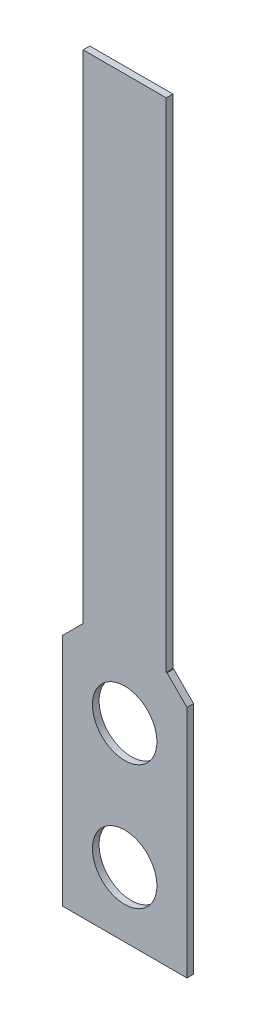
ISO-10303-21;
HEADER;
FILE_DESCRIPTION(('STEP AP214'),'2;1');
FILE_NAME('part.step','',(''),(''),'','','');
FILE_SCHEMA(('AUTOMOTIVE_DESIGN { 1 0 10303 214 1 1 1 1 }'));
ENDSEC;
DATA;
#1=APPLICATION_CONTEXT('core data for automotive mechanical design processes');
#2=APPLICATION_PROTOCOL_DEFINITION('international standard','automotive_design',2000,#1);
#3=PRODUCT_CONTEXT('',#1,'mechanical');
#4=PRODUCT('Part','Part','',(#3));
#5=PRODUCT_RELATED_PRODUCT_CATEGORY('part','',(#4));
#6=PRODUCT_DEFINITION_FORMATION('','',#4);
#7=PRODUCT_DEFINITION_CONTEXT('part definition',#1,'design');
#8=PRODUCT_DEFINITION('design','',#6,#7);
#9=PRODUCT_DEFINITION_SHAPE('','',#8);
#10=(LENGTH_UNIT() NAMED_UNIT(*) SI_UNIT(.MILLI.,.METRE.));
#11=(NAMED_UNIT(*) PLANE_ANGLE_UNIT() SI_UNIT($,.RADIAN.));
#12=(NAMED_UNIT(*) SI_UNIT($,.STERADIAN.) SOLID_ANGLE_UNIT());
#13=UNCERTAINTY_MEASURE_WITH_UNIT(LENGTH_MEASURE(1.E-05),#10,'distance_accuracy_value','');
#14=(GEOMETRIC_REPRESENTATION_CONTEXT(3) GLOBAL_UNCERTAINTY_ASSIGNED_CONTEXT((#13)) GLOBAL_UNIT_ASSIGNED_CONTEXT((#10,
#11,#12)) REPRESENTATION_CONTEXT('',''));
#15=CARTESIAN_POINT('',(0.,0.,0.));
#16=DIRECTION('',(0.,0.,1.));
#17=DIRECTION('',(1.,0.,0.));
#18=AXIS2_PLACEMENT_3D('',#15,#16,#17);
#19=CARTESIAN_POINT('',(3.17500000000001,9.7155,0.508));
#20=DIRECTION('',(0.,-1.,0.));
#21=DIRECTION('',(0.,0.,-1.));
#22=AXIS2_PLACEMENT_3D('',#19,#20,#21);
#23=PLANE('',#22);
#24=DIRECTION('',(-1.,0.,0.));
#25=VECTOR('',#24,1.);
#26=CARTESIAN_POINT('',(3.17500000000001,9.7155,0.508));
#27=LINE('',#26,#25);
#28=CARTESIAN_POINT('',(3.23849999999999,9.7155,0.508));
#29=VERTEX_POINT('',#28);
#30=CARTESIAN_POINT('',(3.17500000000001,9.7155,0.508));
#31=VERTEX_POINT('',#30);
#32=EDGE_CURVE('E144',#29,#31,#27,.T.);
#33=ORIENTED_EDGE('',*,*,#32,.F.);
#34=DIRECTION('',(0.,0.,-1.));
#35=VECTOR('',#34,1.);
#36=CARTESIAN_POINT('',(3.23849999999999,9.7155,0.508));
#37=LINE('',#36,#35);
#38=CARTESIAN_POINT('',(3.23849999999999,9.7155,0.));
#39=VERTEX_POINT('',#38);
#40=EDGE_CURVE('E42',#29,#39,#37,.T.);
#41=ORIENTED_EDGE('',*,*,#40,.T.);
#42=DIRECTION('',(-1.,0.,0.));
#43=VECTOR('',#42,1.);
#44=CARTESIAN_POINT('',(3.17500000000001,9.7155,0.));
#45=LINE('',#44,#43);
#46=CARTESIAN_POINT('',(3.17500000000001,9.7155,0.));
#47=VERTEX_POINT('',#46);
#48=EDGE_CURVE('E135',#39,#47,#45,.T.);
#49=ORIENTED_EDGE('',*,*,#48,.T.);
#50=DIRECTION('',(0.,0.,-1.));
#51=VECTOR('',#50,1.);
#52=CARTESIAN_POINT('',(3.17500000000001,9.7155,0.508));
#53=LINE('',#52,#51);
#54=EDGE_CURVE('E154',#31,#47,#53,.T.);
#55=ORIENTED_EDGE('',*,*,#54,.F.);
#56=EDGE_LOOP('',(#33,#41,#49,#55));
#57=FACE_BOUND('',#56,.T.);
#58=ADVANCED_FACE('F34',(#57),#23,.F.);
#59=CARTESIAN_POINT('',(3.17500000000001,60.2615,0.508));
#60=DIRECTION('',(-1.,0.,0.));
#61=DIRECTION('',(0.,-1.,0.));
#62=AXIS2_PLACEMENT_3D('',#59,#60,#61);
#63=PLANE('',#62);
#64=DIRECTION('',(0.,1.,0.));
#65=VECTOR('',#64,1.);
#66=CARTESIAN_POINT('',(3.17500000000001,60.2615,0.));
#67=LINE('',#66,#65);
#68=CARTESIAN_POINT('',(3.17500000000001,47.7434076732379,0.));
#69=VERTEX_POINT('',#68);
#70=EDGE_CURVE('E131',#47,#69,#67,.T.);
#71=ORIENTED_EDGE('',*,*,#70,.T.);
#72=DIRECTION('',(0.,0.,1.));
#73=VECTOR('',#72,1.);
#74=CARTESIAN_POINT('',(3.17500000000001,47.7434076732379,0.));
#75=LINE('',#74,#73);
#76=CARTESIAN_POINT('',(3.17500000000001,47.7434076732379,0.508));
#77=VERTEX_POINT('',#76);
#78=EDGE_CURVE('E49',#69,#77,#75,.T.);
#79=ORIENTED_EDGE('',*,*,#78,.T.);
#80=DIRECTION('',(0.,1.,0.));
#81=VECTOR('',#80,1.);
#82=CARTESIAN_POINT('',(3.17500000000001,60.2615,0.508));
#83=LINE('',#82,#81);
#84=EDGE_CURVE('E192',#31,#77,#83,.T.);
#85=ORIENTED_EDGE('',*,*,#84,.F.);
#86=ORIENTED_EDGE('',*,*,#54,.T.);
#87=EDGE_LOOP('',(#71,#79,#85,#86));
#88=FACE_BOUND('',#87,.T.);
#89=ADVANCED_FACE('F208',(#88),#63,.F.);
#90=CARTESIAN_POINT('',(-3.17499999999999,60.2615,0.508));
#91=DIRECTION('',(1.,0.,0.));
#92=DIRECTION('',(0.,1.,0.));
#93=AXIS2_PLACEMENT_3D('',#90,#91,#92);
#94=PLANE('',#93);
#95=DIRECTION('',(0.,-1.,0.));
#96=VECTOR('',#95,1.);
#97=CARTESIAN_POINT('',(-3.17499999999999,60.2615,0.508));
#98=LINE('',#97,#96);
#99=CARTESIAN_POINT('',(-3.17499999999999,47.7434076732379,0.508));
#100=VERTEX_POINT('',#99);
#101=CARTESIAN_POINT('',(-3.17499999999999,9.7155,0.508));
#102=VERTEX_POINT('',#101);
#103=EDGE_CURVE('E125',#100,#102,#98,.T.);
#104=ORIENTED_EDGE('',*,*,#103,.F.);
#105=DIRECTION('',(0.,0.,1.));
#106=VECTOR('',#105,1.);
#107=CARTESIAN_POINT('',(-3.17499999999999,47.7434076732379,0.));
#108=LINE('',#107,#106);
#109=CARTESIAN_POINT('',(-3.17499999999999,47.7434076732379,0.));
#110=VERTEX_POINT('',#109);
#111=EDGE_CURVE('E111',#110,#100,#108,.T.);
#112=ORIENTED_EDGE('',*,*,#111,.F.);
#113=DIRECTION('',(0.,-1.,0.));
#114=VECTOR('',#113,1.);
#115=CARTESIAN_POINT('',(-3.17499999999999,60.2615,0.));
#116=LINE('',#115,#114);
#117=CARTESIAN_POINT('',(-3.17499999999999,9.7155,0.));
#118=VERTEX_POINT('',#117);
#119=EDGE_CURVE('E123',#110,#118,#116,.T.);
#120=ORIENTED_EDGE('',*,*,#119,.T.);
#121=DIRECTION('',(0.,0.,-1.));
#122=VECTOR('',#121,1.);
#123=CARTESIAN_POINT('',(-3.17499999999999,9.7155,0.508));
#124=LINE('',#123,#122);
#125=EDGE_CURVE('E152',#102,#118,#124,.T.);
#126=ORIENTED_EDGE('',*,*,#125,.F.);
#127=EDGE_LOOP('',(#104,#112,#120,#126));
#128=FACE_BOUND('',#127,.T.);
#129=ADVANCED_FACE('F121',(#128),#94,.F.);
#130=CARTESIAN_POINT('',(-4.7625,9.7155,0.508));
#131=DIRECTION('',(0.,-1.,0.));
#132=DIRECTION('',(0.,0.,-1.));
#133=AXIS2_PLACEMENT_3D('',#130,#131,#132);
#134=PLANE('',#133);
#135=DIRECTION('',(-1.,0.,0.));
#136=VECTOR('',#135,1.);
#137=CARTESIAN_POINT('',(-4.7625,9.7155,0.));
#138=LINE('',#137,#136);
#139=CARTESIAN_POINT('',(-3.2385,9.7155,0.));
#140=VERTEX_POINT('',#139);
#141=EDGE_CURVE('E130',#118,#140,#138,.T.);
#142=ORIENTED_EDGE('',*,*,#141,.T.);
#143=DIRECTION('',(0.,0.,1.));
#144=VECTOR('',#143,1.);
#145=CARTESIAN_POINT('',(-3.2385,9.7155,0.508));
#146=LINE('',#145,#144);
#147=CARTESIAN_POINT('',(-3.2385,9.7155,0.508));
#148=VERTEX_POINT('',#147);
#149=EDGE_CURVE('E164',#140,#148,#146,.T.);
#150=ORIENTED_EDGE('',*,*,#149,.T.);
#151=DIRECTION('',(-1.,0.,0.));
#152=VECTOR('',#151,1.);
#153=CARTESIAN_POINT('',(-4.7625,9.7155,0.508));
#154=LINE('',#153,#152);
#155=EDGE_CURVE('E188',#102,#148,#154,.T.);
#156=ORIENTED_EDGE('',*,*,#155,.F.);
#157=ORIENTED_EDGE('',*,*,#125,.T.);
#158=EDGE_LOOP('',(#142,#150,#156,#157));
#159=FACE_BOUND('',#158,.T.);
#160=ADVANCED_FACE('F231',(#159),#134,.F.);
#161=CARTESIAN_POINT('',(-4.7625,-9.7155,0.508));
#162=DIRECTION('',(1.,0.,0.));
#163=DIRECTION('',(0.,0.,-1.));
#164=AXIS2_PLACEMENT_3D('',#161,#162,#163);
#165=PLANE('',#164);
#166=DIRECTION('',(0.,-1.,0.));
#167=VECTOR('',#166,1.);
#168=CARTESIAN_POINT('',(-4.7625,-9.7155,0.508));
#169=LINE('',#168,#167);
#170=CARTESIAN_POINT('',(-4.7625,8.19149999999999,0.508));
#171=VERTEX_POINT('',#170);
#172=CARTESIAN_POINT('',(-4.7625,-9.7155,0.508));
#173=VERTEX_POINT('',#172);
#174=EDGE_CURVE('E186',#171,#173,#169,.T.);
#175=ORIENTED_EDGE('',*,*,#174,.F.);
#176=DIRECTION('',(0.,0.,-1.));
#177=VECTOR('',#176,1.);
#178=CARTESIAN_POINT('',(-4.7625,8.1915,0.508));
#179=LINE('',#178,#177);
#180=CARTESIAN_POINT('',(-4.7625,8.19149999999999,0.));
#181=VERTEX_POINT('',#180);
#182=EDGE_CURVE('E157',#171,#181,#179,.T.);
#183=ORIENTED_EDGE('',*,*,#182,.T.);
#184=DIRECTION('',(0.,-1.,0.));
#185=VECTOR('',#184,1.);
#186=CARTESIAN_POINT('',(-4.7625,-9.7155,0.));
#187=LINE('',#186,#185);
#188=CARTESIAN_POINT('',(-4.7625,-9.7155,0.));
#189=VERTEX_POINT('',#188);
#190=EDGE_CURVE('E133',#181,#189,#187,.T.);
#191=ORIENTED_EDGE('',*,*,#190,.T.);
#192=DIRECTION('',(0.,0.,-1.));
#193=VECTOR('',#192,1.);
#194=CARTESIAN_POINT('',(-4.7625,-9.7155,0.508));
#195=LINE('',#194,#193);
#196=EDGE_CURVE('E148',#173,#189,#195,.T.);
#197=ORIENTED_EDGE('',*,*,#196,.F.);
#198=EDGE_LOOP('',(#175,#183,#191,#197));
#199=FACE_BOUND('',#198,.T.);
#200=ADVANCED_FACE('F233',(#199),#165,.F.);
#201=CARTESIAN_POINT('',(-4.7625,-9.7155,0.508));
#202=DIRECTION('',(0.,1.,0.));
#203=DIRECTION('',(0.,0.,1.));
#204=AXIS2_PLACEMENT_3D('',#201,#202,#203);
#205=PLANE('',#204);
#206=DIRECTION('',(1.,0.,0.));
#207=VECTOR('',#206,1.);
#208=CARTESIAN_POINT('',(-4.7625,-9.7155,0.));
#209=LINE('',#208,#207);
#210=CARTESIAN_POINT('',(4.7625,-9.7155,0.));
#211=VERTEX_POINT('',#210);
#212=EDGE_CURVE('E140',#189,#211,#209,.T.);
#213=ORIENTED_EDGE('',*,*,#212,.T.);
#214=DIRECTION('',(0.,0.,-1.));
#215=VECTOR('',#214,1.);
#216=CARTESIAN_POINT('',(4.7625,-9.7155,0.508));
#217=LINE('',#216,#215);
#218=CARTESIAN_POINT('',(4.7625,-9.7155,0.508));
#219=VERTEX_POINT('',#218);
#220=EDGE_CURVE('E145',#219,#211,#217,.T.);
#221=ORIENTED_EDGE('',*,*,#220,.F.);
#222=DIRECTION('',(1.,0.,0.));
#223=VECTOR('',#222,1.);
#224=CARTESIAN_POINT('',(-4.7625,-9.7155,0.508));
#225=LINE('',#224,#223);
#226=EDGE_CURVE('E184',#173,#219,#225,.T.);
#227=ORIENTED_EDGE('',*,*,#226,.F.);
#228=ORIENTED_EDGE('',*,*,#196,.T.);
#229=EDGE_LOOP('',(#213,#221,#227,#228));
#230=FACE_BOUND('',#229,.T.);
#231=ADVANCED_FACE('F237',(#230),#205,.F.);
#232=CARTESIAN_POINT('',(4.7625,-9.7155,0.508));
#233=DIRECTION('',(-1.,0.,0.));
#234=DIRECTION('',(0.,0.,1.));
#235=AXIS2_PLACEMENT_3D('',#232,#233,#234);
#236=PLANE('',#235);
#237=DIRECTION('',(0.,1.,0.));
#238=VECTOR('',#237,1.);
#239=CARTESIAN_POINT('',(4.7625,-9.7155,0.));
#240=LINE('',#239,#238);
#241=CARTESIAN_POINT('',(4.7625,8.1915,0.));
#242=VERTEX_POINT('',#241);
#243=EDGE_CURVE('E142',#211,#242,#240,.T.);
#244=ORIENTED_EDGE('',*,*,#243,.T.);
#245=DIRECTION('',(0.,0.,1.));
#246=VECTOR('',#245,1.);
#247=CARTESIAN_POINT('',(4.7625,8.1915,0.508));
#248=LINE('',#247,#246);
#249=CARTESIAN_POINT('',(4.7625,8.19149999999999,0.508));
#250=VERTEX_POINT('',#249);
#251=EDGE_CURVE('E11',#242,#250,#248,.T.);
#252=ORIENTED_EDGE('',*,*,#251,.T.);
#253=DIRECTION('',(0.,1.,0.));
#254=VECTOR('',#253,1.);
#255=CARTESIAN_POINT('',(4.7625,-9.7155,0.508));
#256=LINE('',#255,#254);
#257=EDGE_CURVE('E149',#219,#250,#256,.T.);
#258=ORIENTED_EDGE('',*,*,#257,.F.);
#259=ORIENTED_EDGE('',*,*,#220,.T.);
#260=EDGE_LOOP('',(#244,#252,#258,#259));
#261=FACE_BOUND('',#260,.T.);
#262=ADVANCED_FACE('F241',(#261),#236,.F.);
#263=CARTESIAN_POINT('',(0.,0.,0.508));
#264=DIRECTION('',(0.,0.,1.));
#265=DIRECTION('',(1.,0.,0.));
#266=AXIS2_PLACEMENT_3D('',#263,#264,#265);
#267=PLANE('',#266);
#268=DIRECTION('',(1.,0.,0.));
#269=VECTOR('',#268,1.);
#270=CARTESIAN_POINT('',(-3.17499999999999,47.7434076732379,0.508));
#271=LINE('',#270,#269);
#272=EDGE_CURVE('E117',#100,#77,#271,.T.);
#273=ORIENTED_EDGE('',*,*,#272,.F.);
#274=ORIENTED_EDGE('',*,*,#103,.T.);
#275=ORIENTED_EDGE('',*,*,#155,.T.);
#276=DIRECTION('',(0.707106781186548,0.707106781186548,0.));
#277=VECTOR('',#276,1.);
#278=CARTESIAN_POINT('',(-6.477,6.477,0.508));
#279=LINE('',#278,#277);
#280=EDGE_CURVE('E168',#148,#171,#279,.F.);
#281=ORIENTED_EDGE('',*,*,#280,.T.);
#282=ORIENTED_EDGE('',*,*,#174,.T.);
#283=ORIENTED_EDGE('',*,*,#226,.T.);
#284=ORIENTED_EDGE('',*,*,#257,.T.);
#285=DIRECTION('',(0.707106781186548,-0.707106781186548,0.));
#286=VECTOR('',#285,1.);
#287=CARTESIAN_POINT('',(6.477,6.477,0.508));
#288=LINE('',#287,#286);
#289=EDGE_CURVE('E166',#250,#29,#288,.F.);
#290=ORIENTED_EDGE('',*,*,#289,.T.);
#291=ORIENTED_EDGE('',*,*,#32,.T.);
#292=ORIENTED_EDGE('',*,*,#84,.T.);
#293=EDGE_LOOP('',(#273,#274,#275,#281,#282,#283,#284,#290,#291,#292));
#294=FACE_BOUND('',#293,.T.);
#295=CARTESIAN_POINT('',(0.,-4.7625,0.508));
#296=DIRECTION('',(0.,0.,1.));
#297=DIRECTION('',(1.,0.,0.));
#298=AXIS2_PLACEMENT_3D('',#295,#296,#297);
#299=CIRCLE('',#298,2.4638);
#300=CARTESIAN_POINT('',(2.4638,-4.7625,0.508));
#301=VERTEX_POINT('',#300);
#302=EDGE_CURVE('E199',#301,#301,#299,.T.);
#303=ORIENTED_EDGE('',*,*,#302,.F.);
#304=EDGE_LOOP('',(#303));
#305=FACE_BOUND('',#304,.T.);
#306=CARTESIAN_POINT('',(0.,4.7625,0.508));
#307=DIRECTION('',(0.,0.,1.));
#308=DIRECTION('',(1.,0.,0.));
#309=AXIS2_PLACEMENT_3D('',#306,#307,#308);
#310=CIRCLE('',#309,2.4638);
#311=CARTESIAN_POINT('',(2.4638,4.7625,0.508));
#312=VERTEX_POINT('',#311);
#313=EDGE_CURVE('E180',#312,#312,#310,.T.);
#314=ORIENTED_EDGE('',*,*,#313,.F.);
#315=EDGE_LOOP('',(#314));
#316=FACE_BOUND('',#315,.T.);
#317=ADVANCED_FACE('F209',(#294,#305,#316),#267,.T.);
#318=CARTESIAN_POINT('',(0.,0.,0.));
#319=DIRECTION('',(0.,0.,1.));
#320=DIRECTION('',(1.,0.,0.));
#321=AXIS2_PLACEMENT_3D('',#318,#319,#320);
#322=PLANE('',#321);
#323=CARTESIAN_POINT('',(0.,-4.7625,0.));
#324=DIRECTION('',(0.,0.,1.));
#325=DIRECTION('',(1.,0.,0.));
#326=AXIS2_PLACEMENT_3D('',#323,#324,#325);
#327=CIRCLE('',#326,2.4638);
#328=CARTESIAN_POINT('',(2.4638,-4.7625,0.));
#329=VERTEX_POINT('',#328);
#330=EDGE_CURVE('E197',#329,#329,#327,.T.);
#331=ORIENTED_EDGE('',*,*,#330,.T.);
#332=EDGE_LOOP('',(#331));
#333=FACE_BOUND('',#332,.T.);
#334=CARTESIAN_POINT('',(0.,4.7625,0.));
#335=DIRECTION('',(0.,0.,1.));
#336=DIRECTION('',(1.,0.,0.));
#337=AXIS2_PLACEMENT_3D('',#334,#335,#336);
#338=CIRCLE('',#337,2.4638);
#339=CARTESIAN_POINT('',(2.4638,4.7625,0.));
#340=VERTEX_POINT('',#339);
#341=EDGE_CURVE('E178',#340,#340,#338,.T.);
#342=ORIENTED_EDGE('',*,*,#341,.T.);
#343=EDGE_LOOP('',(#342));
#344=FACE_BOUND('',#343,.T.);
#345=ORIENTED_EDGE('',*,*,#119,.F.);
#346=DIRECTION('',(1.,0.,0.));
#347=VECTOR('',#346,1.);
#348=CARTESIAN_POINT('',(-3.17499999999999,47.7434076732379,0.));
#349=LINE('',#348,#347);
#350=EDGE_CURVE('E108',#110,#69,#349,.T.);
#351=ORIENTED_EDGE('',*,*,#350,.T.);
#352=ORIENTED_EDGE('',*,*,#70,.F.);
#353=ORIENTED_EDGE('',*,*,#48,.F.);
#354=DIRECTION('',(-0.707106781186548,0.707106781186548,0.));
#355=VECTOR('',#354,1.);
#356=CARTESIAN_POINT('',(3.23849999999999,9.7155,0.));
#357=LINE('',#356,#355);
#358=EDGE_CURVE('E160',#39,#242,#357,.F.);
#359=ORIENTED_EDGE('',*,*,#358,.T.);
#360=ORIENTED_EDGE('',*,*,#243,.F.);
#361=ORIENTED_EDGE('',*,*,#212,.F.);
#362=ORIENTED_EDGE('',*,*,#190,.F.);
#363=DIRECTION('',(-0.707106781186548,-0.707106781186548,0.));
#364=VECTOR('',#363,1.);
#365=CARTESIAN_POINT('',(-4.7625,8.1915,0.));
#366=LINE('',#365,#364);
#367=EDGE_CURVE('E162',#181,#140,#366,.F.);
#368=ORIENTED_EDGE('',*,*,#367,.T.);
#369=ORIENTED_EDGE('',*,*,#141,.F.);
#370=EDGE_LOOP('',(#345,#351,#352,#353,#359,#360,#361,#362,#368,#369));
#371=FACE_BOUND('',#370,.T.);
#372=ADVANCED_FACE('F128',(#333,#344,#371),#322,.F.);
#373=CARTESIAN_POINT('',(0.,4.7625,0.));
#374=DIRECTION('',(0.,0.,1.));
#375=DIRECTION('',(1.,0.,0.));
#376=AXIS2_PLACEMENT_3D('',#373,#374,#375);
#377=CYLINDRICAL_SURFACE('',#376,2.4638);
#378=ORIENTED_EDGE('',*,*,#341,.F.);
#379=EDGE_LOOP('',(#378));
#380=FACE_BOUND('',#379,.T.);
#381=ORIENTED_EDGE('',*,*,#313,.T.);
#382=EDGE_LOOP('',(#381));
#383=FACE_BOUND('',#382,.T.);
#384=ADVANCED_FACE('F247',(#380,#383),#377,.F.);
#385=CARTESIAN_POINT('',(0.,-4.7625,0.));
#386=DIRECTION('',(0.,0.,1.));
#387=DIRECTION('',(1.,0.,0.));
#388=AXIS2_PLACEMENT_3D('',#385,#386,#387);
#389=CYLINDRICAL_SURFACE('',#388,2.4638);
#390=ORIENTED_EDGE('',*,*,#330,.F.);
#391=EDGE_LOOP('',(#390));
#392=FACE_BOUND('',#391,.T.);
#393=ORIENTED_EDGE('',*,*,#302,.T.);
#394=EDGE_LOOP('',(#393));
#395=FACE_BOUND('',#394,.T.);
#396=ADVANCED_FACE('F218',(#392,#395),#389,.F.);
#397=CARTESIAN_POINT('',(-4.7625,8.1915,0.508));
#398=DIRECTION('',(0.707106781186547,-0.707106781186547,0.));
#399=DIRECTION('',(0.,0.,-1.));
#400=AXIS2_PLACEMENT_3D('',#397,#398,#399);
#401=PLANE('',#400);
#402=ORIENTED_EDGE('',*,*,#280,.F.);
#403=ORIENTED_EDGE('',*,*,#149,.F.);
#404=ORIENTED_EDGE('',*,*,#367,.F.);
#405=ORIENTED_EDGE('',*,*,#182,.F.);
#406=EDGE_LOOP('',(#402,#403,#404,#405));
#407=FACE_BOUND('',#406,.T.);
#408=ADVANCED_FACE('F212',(#407),#401,.F.);
#409=CARTESIAN_POINT('',(3.23849999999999,9.7155,0.508));
#410=DIRECTION('',(-0.707106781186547,-0.707106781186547,0.));
#411=DIRECTION('',(0.,0.,-1.));
#412=AXIS2_PLACEMENT_3D('',#409,#410,#411);
#413=PLANE('',#412);
#414=ORIENTED_EDGE('',*,*,#289,.F.);
#415=ORIENTED_EDGE('',*,*,#251,.F.);
#416=ORIENTED_EDGE('',*,*,#358,.F.);
#417=ORIENTED_EDGE('',*,*,#40,.F.);
#418=EDGE_LOOP('',(#414,#415,#416,#417));
#419=FACE_BOUND('',#418,.T.);
#420=ADVANCED_FACE('F36',(#419),#413,.F.);
#421=CARTESIAN_POINT('',(-3.17499999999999,47.7434076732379,0.));
#422=DIRECTION('',(0.,-1.,0.));
#423=DIRECTION('',(0.,0.,-1.));
#424=AXIS2_PLACEMENT_3D('',#421,#422,#423);
#425=PLANE('',#424);
#426=ORIENTED_EDGE('',*,*,#272,.T.);
#427=ORIENTED_EDGE('',*,*,#78,.F.);
#428=ORIENTED_EDGE('',*,*,#350,.F.);
#429=ORIENTED_EDGE('',*,*,#111,.T.);
#430=EDGE_LOOP('',(#426,#427,#428,#429));
#431=FACE_BOUND('',#430,.T.);
#432=ADVANCED_FACE('F110',(#431),#425,.F.);
#433=CLOSED_SHELL('',(#58,#89,#129,#160,#200,#231,#262,#317,#372,#384,#396,#408,#420,#432));
#434=MANIFOLD_SOLID_BREP('B2',#433);
#435=ADVANCED_BREP_SHAPE_REPRESENTATION('',(#18,#434),#14);
#436=SHAPE_DEFINITION_REPRESENTATION(#9,#435);
ENDSEC;
END-ISO-10303-21;
